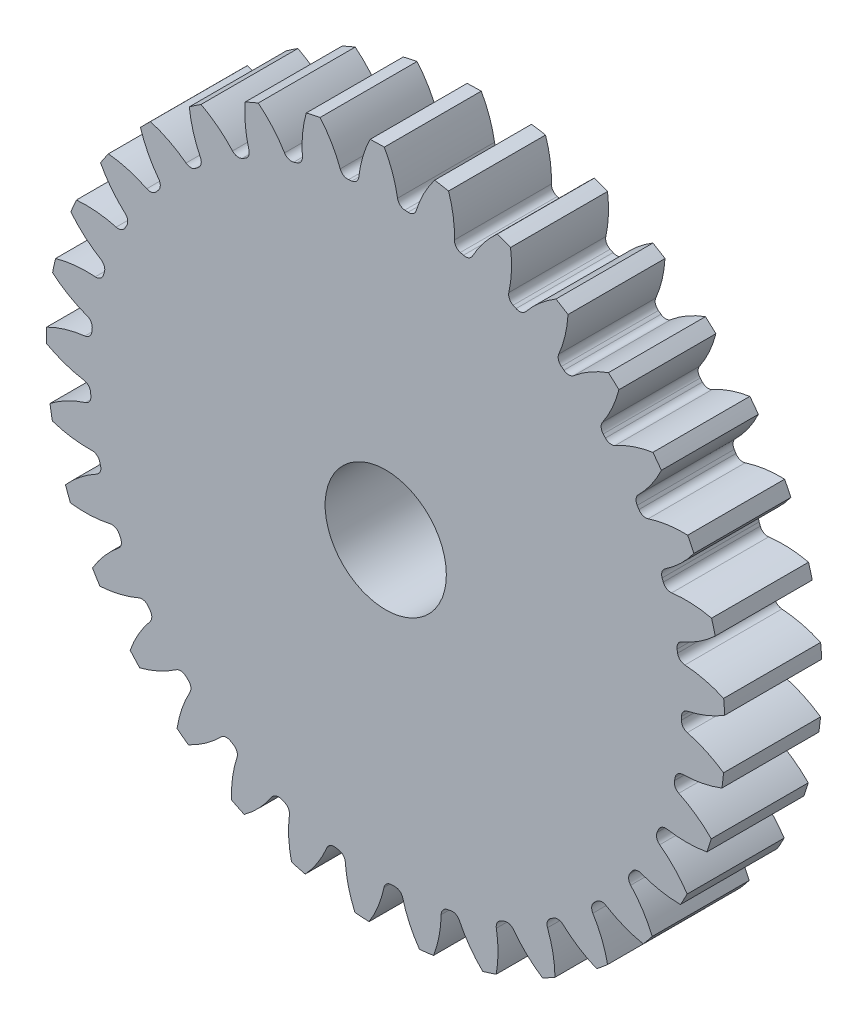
from build123d import *

# Parameters (mm, degrees)
SKETCH3_R         = 355.6
GEARBODY_DEPTH    = 101.6
TOOTHCUT_DEPTH    = 514.054850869
CIRPATTERN1_COUNT = 33
BOREDIA_R         = 63.5
BORE_DEPTH        = 12700


with BuildPart() as part:
    # Sketch3 → gearBody (new body)
    with BuildSketch(Plane.XY):
        Circle(SKETCH3_R)
    extrude(amount=GEARBODY_DEPTH)

    # Sketch2 → toothCut (cut, through all)
    with BuildSketch(Plane.XY):
        with BuildLine():
            ThreePointArc((309.758604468, -8.67302474), (309.801834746, -6.95971177), (309.835588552, -5.24618591))
            ThreePointArc((309.835588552, -5.24618591), (311.716668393, -0.133518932), (316.369530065, 2.699977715))
            ThreePointArc((316.369530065, 2.699977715), (336.695086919, 8.981254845), (355.6, 18.73763559))
            ThreePointArc((355.6, 18.73763559), (356.00350677, -7.997634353), (354.399794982, -34.687812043))
            ThreePointArc((354.399794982, -34.687812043), (335.952087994, -24.092303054), (315.929112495, -16.90459438))
            ThreePointArc((315.929112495, -16.90459438), (311.408189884, -13.865008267), (309.758604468, -8.67302474))
        make_face()
    toothcut = extrude(amount=TOOTHCUT_DEPTH, mode=Mode.SUBTRACT)

    # CirPattern1: toothCut ×33 about axis
    cirpattern1_axis = Axis((0, 0, 0), (0, 0, 1))
    for i in range(1, CIRPATTERN1_COUNT):
        add(toothcut.rotate(cirpattern1_axis, i * 360 / CIRPATTERN1_COUNT), mode=Mode.SUBTRACT)

    # boreDia → bore (cut, symmetric)
    with BuildSketch(Plane.XY):
        Circle(BOREDIA_R)
    extrude(amount=BORE_DEPTH, both=True, mode=Mode.SUBTRACT)


solid = part.part
